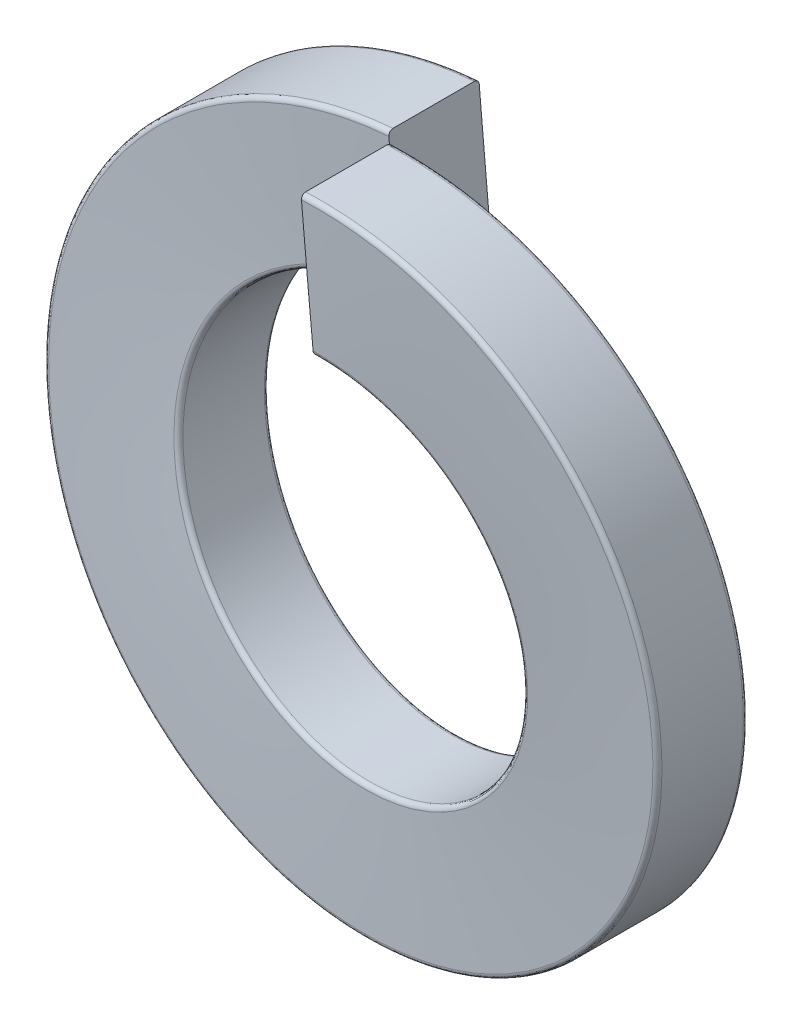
from build123d import *

# Parameters (mm, degrees)
SWEEP1_PITCH            = 1.1176
SWEEP1_HEIGHT           = 1.1176
SWEEP1_RADIUS           = 3.7211
SWEEP1_START_ANGLE      = 90
SKETCH4_W               = 1.016
SKETCH4_H               = 1.5113
FILLET1_R               = 0.0508
CUT_EXTRUDE1_DEPTH      = 6.379810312
CUT_EXTRUDE1_DEPTH_BACK = 6.379810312


with BuildPart() as part:
    # Sweep1: sweep along a helix
    with BuildLine() as sweep1_path:
        add(Helix(SWEEP1_PITCH, SWEEP1_HEIGHT, SWEEP1_RADIUS, center=(0, 0, -1.1176), direction=(0, 0, 1), mode=Mode.PRIVATE).rotate(Axis((0, 0, -1.1176), (0, 0, 1)), SWEEP1_START_ANGLE))
    # Sketch4 → Sweep1 (sweep)
    with BuildSketch(Plane(origin=(0, 0, 0), x_dir=(0, 0, -1), z_dir=(1, 0, 0))):
        with Locations((0.6096, 2.96545)):
            Rectangle(SKETCH4_W, SKETCH4_H)
    sweep(path=sweep1_path.line, is_frenet=True)

    # Fillet1
    fillet1_edges = [part.edges().sort_by_distance(p)[0] for p in [
        (0, -3.721095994, 0.4572),
        (0, -2.209797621, 0.4572),
        (0, -2.209797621, -0.5588),
        (0, -3.721095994, -0.5588),
    ]]
    fillet(fillet1_edges, radius=FILLET1_R)

    # Sketch5 → Cut-Extrude1 (cut, two sides: drawn at the far end of the back side and taken through both)
    with BuildSketch(Plane.XY.offset(-CUT_EXTRUDE1_DEPTH_BACK)):
        with BuildLine():
            Line((0, 3.7211), (0.130390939, 2.205949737))
            Line((0.130390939, 2.205949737), (0.130390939, 0))
            Line((0.130390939, 0), (0, 0))
            Line((0, 0), (0, 2.2098))
            Line((0, 2.2098), (-0.129864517, 3.718833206))
            ThreePointArc((-0.129864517, 3.718833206), (-0.06494215, 3.720533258), (0, 3.7211))
        make_face()
    extrude(amount=CUT_EXTRUDE1_DEPTH + CUT_EXTRUDE1_DEPTH_BACK, mode=Mode.SUBTRACT)


solid = part.part
